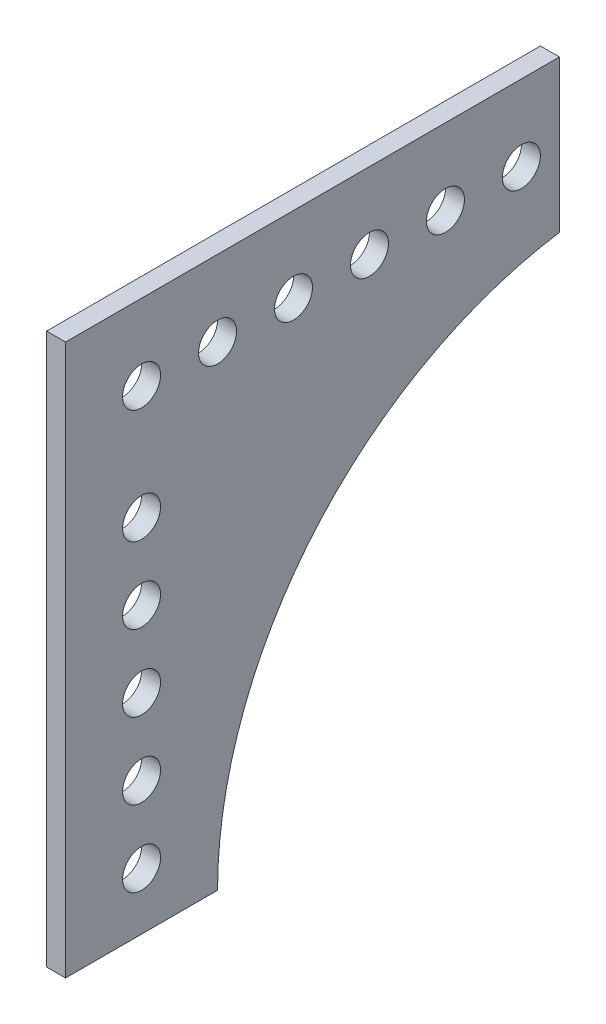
ISO-10303-21;
HEADER;
FILE_DESCRIPTION(('STEP AP214'),'2;1');
FILE_NAME('part.step','',(''),(''),'','','');
FILE_SCHEMA(('AUTOMOTIVE_DESIGN { 1 0 10303 214 1 1 1 1 }'));
ENDSEC;
DATA;
#1=APPLICATION_CONTEXT('core data for automotive mechanical design processes');
#2=APPLICATION_PROTOCOL_DEFINITION('international standard','automotive_design',2000,#1);
#3=PRODUCT_CONTEXT('',#1,'mechanical');
#4=PRODUCT('Part','Part','',(#3));
#5=PRODUCT_RELATED_PRODUCT_CATEGORY('part','',(#4));
#6=PRODUCT_DEFINITION_FORMATION('','',#4);
#7=PRODUCT_DEFINITION_CONTEXT('part definition',#1,'design');
#8=PRODUCT_DEFINITION('design','',#6,#7);
#9=PRODUCT_DEFINITION_SHAPE('','',#8);
#10=(LENGTH_UNIT() NAMED_UNIT(*) SI_UNIT(.MILLI.,.METRE.));
#11=(NAMED_UNIT(*) PLANE_ANGLE_UNIT() SI_UNIT($,.RADIAN.));
#12=(NAMED_UNIT(*) SI_UNIT($,.STERADIAN.) SOLID_ANGLE_UNIT());
#13=UNCERTAINTY_MEASURE_WITH_UNIT(LENGTH_MEASURE(1.E-05),#10,'distance_accuracy_value','');
#14=(GEOMETRIC_REPRESENTATION_CONTEXT(3) GLOBAL_UNCERTAINTY_ASSIGNED_CONTEXT((#13)) GLOBAL_UNIT_ASSIGNED_CONTEXT((#10,
#11,#12)) REPRESENTATION_CONTEXT('',''));
#15=CARTESIAN_POINT('',(0.,0.,0.));
#16=DIRECTION('',(0.,0.,1.));
#17=DIRECTION('',(1.,0.,0.));
#18=AXIS2_PLACEMENT_3D('',#15,#16,#17);
#19=CARTESIAN_POINT('',(149.574300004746,240.335090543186,0.));
#20=DIRECTION('',(0.,1.,0.));
#21=DIRECTION('',(0.,0.,1.));
#22=AXIS2_PLACEMENT_3D('',#19,#20,#21);
#23=PLANE('',#22);
#24=DIRECTION('',(0.,0.,-1.));
#25=VECTOR('',#24,1.);
#26=CARTESIAN_POINT('',(146.399300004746,240.335090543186,0.));
#27=LINE('',#26,#25);
#28=CARTESIAN_POINT('',(146.399300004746,240.335090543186,622.24027161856));
#29=VERTEX_POINT('',#28);
#30=CARTESIAN_POINT('',(146.399300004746,240.335090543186,596.84027161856));
#31=VERTEX_POINT('',#30);
#32=EDGE_CURVE('E157',#29,#31,#27,.T.);
#33=ORIENTED_EDGE('',*,*,#32,.T.);
#34=DIRECTION('',(-1.,0.,0.));
#35=VECTOR('',#34,1.);
#36=CARTESIAN_POINT('',(149.574300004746,240.335090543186,596.84027161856));
#37=LINE('',#36,#35);
#38=CARTESIAN_POINT('',(149.574300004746,240.335090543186,596.84027161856));
#39=VERTEX_POINT('',#38);
#40=EDGE_CURVE('E11',#39,#31,#37,.T.);
#41=ORIENTED_EDGE('',*,*,#40,.F.);
#42=DIRECTION('',(0.,0.,-1.));
#43=VECTOR('',#42,1.);
#44=CARTESIAN_POINT('',(149.574300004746,240.335090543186,0.));
#45=LINE('',#44,#43);
#46=CARTESIAN_POINT('',(149.574300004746,240.335090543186,622.24027161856));
#47=VERTEX_POINT('',#46);
#48=EDGE_CURVE('E116',#47,#39,#45,.T.);
#49=ORIENTED_EDGE('',*,*,#48,.F.);
#50=DIRECTION('',(-1.,0.,0.));
#51=VECTOR('',#50,1.);
#52=CARTESIAN_POINT('',(149.574300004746,240.335090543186,622.24027161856));
#53=LINE('',#52,#51);
#54=EDGE_CURVE('E57',#47,#29,#53,.T.);
#55=ORIENTED_EDGE('',*,*,#54,.T.);
#56=EDGE_LOOP('',(#33,#41,#49,#55));
#57=FACE_BOUND('',#56,.T.);
#58=ADVANCED_FACE('F39',(#57),#23,.F.);
#59=CARTESIAN_POINT('',(149.574300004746,240.335090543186,529.37152161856));
#60=DIRECTION('',(-1.,0.,0.));
#61=DIRECTION('',(0.,0.,1.));
#62=AXIS2_PLACEMENT_3D('',#59,#60,#61);
#63=CYLINDRICAL_SURFACE('',#62,67.46875);
#64=CARTESIAN_POINT('',(146.399300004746,240.335090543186,529.37152161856));
#65=DIRECTION('',(1.,0.,0.));
#66=DIRECTION('',(0.,0.,-1.));
#67=AXIS2_PLACEMENT_3D('',#64,#65,#66);
#68=CIRCLE('',#67,67.46875);
#69=CARTESIAN_POINT('',(146.399300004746,307.010090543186,539.69027161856));
#70=VERTEX_POINT('',#69);
#71=EDGE_CURVE('E160',#31,#70,#68,.F.);
#72=ORIENTED_EDGE('',*,*,#71,.T.);
#73=DIRECTION('',(-1.,0.,0.));
#74=VECTOR('',#73,1.);
#75=CARTESIAN_POINT('',(149.574300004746,307.010090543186,539.69027161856));
#76=LINE('',#75,#74);
#77=CARTESIAN_POINT('',(149.574300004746,307.010090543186,539.69027161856));
#78=VERTEX_POINT('',#77);
#79=EDGE_CURVE('E49',#78,#70,#76,.T.);
#80=ORIENTED_EDGE('',*,*,#79,.F.);
#81=CARTESIAN_POINT('',(149.574300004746,240.335090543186,529.37152161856));
#82=DIRECTION('',(1.,0.,0.));
#83=DIRECTION('',(0.,0.,-1.));
#84=AXIS2_PLACEMENT_3D('',#81,#82,#83);
#85=CIRCLE('',#84,67.46875);
#86=EDGE_CURVE('E89',#39,#78,#85,.F.);
#87=ORIENTED_EDGE('',*,*,#86,.F.);
#88=ORIENTED_EDGE('',*,*,#40,.T.);
#89=EDGE_LOOP('',(#72,#80,#87,#88));
#90=FACE_BOUND('',#89,.T.);
#91=ADVANCED_FACE('F190',(#90),#63,.F.);
#92=CARTESIAN_POINT('',(149.574300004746,0.,539.69027161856));
#93=DIRECTION('',(0.,0.,-1.));
#94=DIRECTION('',(-1.,0.,0.));
#95=AXIS2_PLACEMENT_3D('',#92,#93,#94);
#96=PLANE('',#95);
#97=DIRECTION('',(0.,-1.,0.));
#98=VECTOR('',#97,1.);
#99=CARTESIAN_POINT('',(146.399300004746,0.,539.69027161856));
#100=LINE('',#99,#98);
#101=CARTESIAN_POINT('',(146.399300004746,332.410090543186,539.69027161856));
#102=VERTEX_POINT('',#101);
#103=EDGE_CURVE('E102',#102,#70,#100,.T.);
#104=ORIENTED_EDGE('',*,*,#103,.F.);
#105=DIRECTION('',(-1.,0.,0.));
#106=VECTOR('',#105,1.);
#107=CARTESIAN_POINT('',(149.574300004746,332.410090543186,539.69027161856));
#108=LINE('',#107,#106);
#109=CARTESIAN_POINT('',(149.574300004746,332.410090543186,539.69027161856));
#110=VERTEX_POINT('',#109);
#111=EDGE_CURVE('E96',#110,#102,#108,.T.);
#112=ORIENTED_EDGE('',*,*,#111,.F.);
#113=DIRECTION('',(0.,-1.,0.));
#114=VECTOR('',#113,1.);
#115=CARTESIAN_POINT('',(149.574300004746,0.,539.69027161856));
#116=LINE('',#115,#114);
#117=EDGE_CURVE('E100',#110,#78,#116,.T.);
#118=ORIENTED_EDGE('',*,*,#117,.T.);
#119=ORIENTED_EDGE('',*,*,#79,.T.);
#120=EDGE_LOOP('',(#104,#112,#118,#119));
#121=FACE_BOUND('',#120,.T.);
#122=ADVANCED_FACE('F98',(#121),#96,.T.);
#123=CARTESIAN_POINT('',(149.574300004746,332.410090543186,0.));
#124=DIRECTION('',(0.,-1.,0.));
#125=DIRECTION('',(0.,0.,-1.));
#126=AXIS2_PLACEMENT_3D('',#123,#124,#125);
#127=PLANE('',#126);
#128=DIRECTION('',(0.,0.,1.));
#129=VECTOR('',#128,1.);
#130=CARTESIAN_POINT('',(146.399300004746,332.410090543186,0.));
#131=LINE('',#130,#129);
#132=CARTESIAN_POINT('',(146.399300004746,332.410090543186,622.24027161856));
#133=VERTEX_POINT('',#132);
#134=EDGE_CURVE('E165',#102,#133,#131,.T.);
#135=ORIENTED_EDGE('',*,*,#134,.T.);
#136=DIRECTION('',(-1.,0.,0.));
#137=VECTOR('',#136,1.);
#138=CARTESIAN_POINT('',(149.574300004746,332.410090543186,622.24027161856));
#139=LINE('',#138,#137);
#140=CARTESIAN_POINT('',(149.574300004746,332.410090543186,622.24027161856));
#141=VERTEX_POINT('',#140);
#142=EDGE_CURVE('E76',#141,#133,#139,.T.);
#143=ORIENTED_EDGE('',*,*,#142,.F.);
#144=DIRECTION('',(0.,0.,1.));
#145=VECTOR('',#144,1.);
#146=CARTESIAN_POINT('',(149.574300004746,332.410090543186,0.));
#147=LINE('',#146,#145);
#148=EDGE_CURVE('E106',#110,#141,#147,.T.);
#149=ORIENTED_EDGE('',*,*,#148,.F.);
#150=ORIENTED_EDGE('',*,*,#111,.T.);
#151=EDGE_LOOP('',(#135,#143,#149,#150));
#152=FACE_BOUND('',#151,.T.);
#153=ADVANCED_FACE('F107',(#152),#127,.F.);
#154=CARTESIAN_POINT('',(149.574300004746,319.710090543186,571.44027161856));
#155=DIRECTION('',(-1.,0.,0.));
#156=DIRECTION('',(0.,0.,1.));
#157=AXIS2_PLACEMENT_3D('',#154,#155,#156);
#158=CYLINDRICAL_SURFACE('',#157,3.17499999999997);
#159=CARTESIAN_POINT('',(149.574300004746,319.710090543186,571.44027161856));
#160=DIRECTION('',(1.,0.,0.));
#161=DIRECTION('',(0.,0.,-1.));
#162=AXIS2_PLACEMENT_3D('',#159,#160,#161);
#163=CIRCLE('',#162,3.17499999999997);
#164=CARTESIAN_POINT('',(149.574300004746,319.710090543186,568.265271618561));
#165=VERTEX_POINT('',#164);
#166=EDGE_CURVE('E133',#165,#165,#163,.F.);
#167=ORIENTED_EDGE('',*,*,#166,.F.);
#168=EDGE_LOOP('',(#167));
#169=FACE_BOUND('',#168,.T.);
#170=CARTESIAN_POINT('',(146.399300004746,319.710090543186,571.44027161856));
#171=DIRECTION('',(1.,0.,0.));
#172=DIRECTION('',(0.,0.,-1.));
#173=AXIS2_PLACEMENT_3D('',#170,#171,#172);
#174=CIRCLE('',#173,3.17499999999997);
#175=CARTESIAN_POINT('',(146.399300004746,319.710090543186,568.265271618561));
#176=VERTEX_POINT('',#175);
#177=EDGE_CURVE('E182',#176,#176,#174,.F.);
#178=ORIENTED_EDGE('',*,*,#177,.T.);
#179=EDGE_LOOP('',(#178));
#180=FACE_BOUND('',#179,.T.);
#181=ADVANCED_FACE('F260',(#169,#180),#158,.F.);
#182=CARTESIAN_POINT('',(149.574300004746,319.710090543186,546.04027161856));
#183=DIRECTION('',(-1.,0.,0.));
#184=DIRECTION('',(0.,0.,1.));
#185=AXIS2_PLACEMENT_3D('',#182,#183,#184);
#186=CYLINDRICAL_SURFACE('',#185,3.17499999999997);
#187=CARTESIAN_POINT('',(149.574300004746,319.710090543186,546.04027161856));
#188=DIRECTION('',(1.,0.,0.));
#189=DIRECTION('',(0.,0.,-1.));
#190=AXIS2_PLACEMENT_3D('',#187,#188,#189);
#191=CIRCLE('',#190,3.17499999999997);
#192=CARTESIAN_POINT('',(149.574300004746,319.710090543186,542.865271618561));
#193=VERTEX_POINT('',#192);
#194=EDGE_CURVE('E130',#193,#193,#191,.F.);
#195=ORIENTED_EDGE('',*,*,#194,.F.);
#196=EDGE_LOOP('',(#195));
#197=FACE_BOUND('',#196,.T.);
#198=CARTESIAN_POINT('',(146.399300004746,319.710090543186,546.04027161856));
#199=DIRECTION('',(1.,0.,0.));
#200=DIRECTION('',(0.,0.,-1.));
#201=AXIS2_PLACEMENT_3D('',#198,#199,#200);
#202=CIRCLE('',#201,3.17499999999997);
#203=CARTESIAN_POINT('',(146.399300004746,319.710090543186,542.865271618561));
#204=VERTEX_POINT('',#203);
#205=EDGE_CURVE('E179',#204,#204,#202,.F.);
#206=ORIENTED_EDGE('',*,*,#205,.T.);
#207=EDGE_LOOP('',(#206));
#208=FACE_BOUND('',#207,.T.);
#209=ADVANCED_FACE('F263',(#197,#208),#186,.F.);
#210=CARTESIAN_POINT('',(149.574300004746,319.710090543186,558.740271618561));
#211=DIRECTION('',(-1.,0.,0.));
#212=DIRECTION('',(0.,0.,1.));
#213=AXIS2_PLACEMENT_3D('',#210,#211,#212);
#214=CYLINDRICAL_SURFACE('',#213,3.17499999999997);
#215=CARTESIAN_POINT('',(149.574300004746,319.710090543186,558.740271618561));
#216=DIRECTION('',(1.,0.,0.));
#217=DIRECTION('',(0.,0.,-1.));
#218=AXIS2_PLACEMENT_3D('',#215,#216,#217);
#219=CIRCLE('',#218,3.17499999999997);
#220=CARTESIAN_POINT('',(149.574300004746,319.710090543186,555.565271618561));
#221=VERTEX_POINT('',#220);
#222=EDGE_CURVE('E127',#221,#221,#219,.F.);
#223=ORIENTED_EDGE('',*,*,#222,.F.);
#224=EDGE_LOOP('',(#223));
#225=FACE_BOUND('',#224,.T.);
#226=CARTESIAN_POINT('',(146.399300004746,319.710090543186,558.740271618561));
#227=DIRECTION('',(1.,0.,0.));
#228=DIRECTION('',(0.,0.,-1.));
#229=AXIS2_PLACEMENT_3D('',#226,#227,#228);
#230=CIRCLE('',#229,3.17499999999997);
#231=CARTESIAN_POINT('',(146.399300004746,319.710090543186,555.565271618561));
#232=VERTEX_POINT('',#231);
#233=EDGE_CURVE('E176',#232,#232,#230,.F.);
#234=ORIENTED_EDGE('',*,*,#233,.T.);
#235=EDGE_LOOP('',(#234));
#236=FACE_BOUND('',#235,.T.);
#237=ADVANCED_FACE('F267',(#225,#236),#214,.F.);
#238=CARTESIAN_POINT('',(149.574300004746,319.710090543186,584.140271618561));
#239=DIRECTION('',(-1.,0.,0.));
#240=DIRECTION('',(0.,0.,1.));
#241=AXIS2_PLACEMENT_3D('',#238,#239,#240);
#242=CYLINDRICAL_SURFACE('',#241,3.17499999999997);
#243=CARTESIAN_POINT('',(149.574300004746,319.710090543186,584.140271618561));
#244=DIRECTION('',(1.,0.,0.));
#245=DIRECTION('',(0.,0.,-1.));
#246=AXIS2_PLACEMENT_3D('',#243,#244,#245);
#247=CIRCLE('',#246,3.17499999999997);
#248=CARTESIAN_POINT('',(149.574300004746,319.710090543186,580.965271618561));
#249=VERTEX_POINT('',#248);
#250=EDGE_CURVE('E124',#249,#249,#247,.F.);
#251=ORIENTED_EDGE('',*,*,#250,.F.);
#252=EDGE_LOOP('',(#251));
#253=FACE_BOUND('',#252,.T.);
#254=CARTESIAN_POINT('',(146.399300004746,319.710090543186,584.140271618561));
#255=DIRECTION('',(1.,0.,0.));
#256=DIRECTION('',(0.,0.,-1.));
#257=AXIS2_PLACEMENT_3D('',#254,#255,#256);
#258=CIRCLE('',#257,3.17499999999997);
#259=CARTESIAN_POINT('',(146.399300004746,319.710090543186,580.965271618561));
#260=VERTEX_POINT('',#259);
#261=EDGE_CURVE('E173',#260,#260,#258,.F.);
#262=ORIENTED_EDGE('',*,*,#261,.T.);
#263=EDGE_LOOP('',(#262));
#264=FACE_BOUND('',#263,.T.);
#265=ADVANCED_FACE('F207',(#253,#264),#242,.F.);
#266=CARTESIAN_POINT('',(149.574300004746,319.710090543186,609.54027161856));
#267=DIRECTION('',(-1.,0.,0.));
#268=DIRECTION('',(0.,0.,1.));
#269=AXIS2_PLACEMENT_3D('',#266,#267,#268);
#270=CYLINDRICAL_SURFACE('',#269,3.17499999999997);
#271=CARTESIAN_POINT('',(149.574300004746,319.710090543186,609.54027161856));
#272=DIRECTION('',(1.,0.,0.));
#273=DIRECTION('',(0.,0.,-1.));
#274=AXIS2_PLACEMENT_3D('',#271,#272,#273);
#275=CIRCLE('',#274,3.17499999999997);
#276=CARTESIAN_POINT('',(149.574300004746,319.710090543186,606.365271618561));
#277=VERTEX_POINT('',#276);
#278=EDGE_CURVE('E121',#277,#277,#275,.F.);
#279=ORIENTED_EDGE('',*,*,#278,.F.);
#280=EDGE_LOOP('',(#279));
#281=FACE_BOUND('',#280,.T.);
#282=CARTESIAN_POINT('',(146.399300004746,319.710090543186,609.54027161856));
#283=DIRECTION('',(1.,0.,0.));
#284=DIRECTION('',(0.,0.,-1.));
#285=AXIS2_PLACEMENT_3D('',#282,#283,#284);
#286=CIRCLE('',#285,3.17499999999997);
#287=CARTESIAN_POINT('',(146.399300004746,319.710090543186,606.365271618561));
#288=VERTEX_POINT('',#287);
#289=EDGE_CURVE('E170',#288,#288,#286,.F.);
#290=ORIENTED_EDGE('',*,*,#289,.T.);
#291=EDGE_LOOP('',(#290));
#292=FACE_BOUND('',#291,.T.);
#293=ADVANCED_FACE('F198',(#281,#292),#270,.F.);
#294=CARTESIAN_POINT('',(149.574300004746,0.,622.24027161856));
#295=DIRECTION('',(0.,0.,1.));
#296=DIRECTION('',(1.,0.,0.));
#297=AXIS2_PLACEMENT_3D('',#294,#295,#296);
#298=PLANE('',#297);
#299=DIRECTION('',(0.,1.,0.));
#300=VECTOR('',#299,1.);
#301=CARTESIAN_POINT('',(146.399300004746,0.,622.24027161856));
#302=LINE('',#301,#300);
#303=EDGE_CURVE('E167',#29,#133,#302,.T.);
#304=ORIENTED_EDGE('',*,*,#303,.F.);
#305=ORIENTED_EDGE('',*,*,#54,.F.);
#306=DIRECTION('',(0.,1.,0.));
#307=VECTOR('',#306,1.);
#308=CARTESIAN_POINT('',(149.574300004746,0.,622.24027161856));
#309=LINE('',#308,#307);
#310=EDGE_CURVE('E110',#47,#141,#309,.T.);
#311=ORIENTED_EDGE('',*,*,#310,.T.);
#312=ORIENTED_EDGE('',*,*,#142,.T.);
#313=EDGE_LOOP('',(#304,#305,#311,#312));
#314=FACE_BOUND('',#313,.T.);
#315=ADVANCED_FACE('F195',(#314),#298,.T.);
#316=CARTESIAN_POINT('',(149.574300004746,300.660090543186,609.54027161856));
#317=DIRECTION('',(-1.,0.,0.));
#318=DIRECTION('',(0.,0.,1.));
#319=AXIS2_PLACEMENT_3D('',#316,#317,#318);
#320=CYLINDRICAL_SURFACE('',#319,3.17500000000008);
#321=CARTESIAN_POINT('',(149.574300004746,300.660090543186,609.54027161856));
#322=DIRECTION('',(1.,0.,0.));
#323=DIRECTION('',(0.,0.,-1.));
#324=AXIS2_PLACEMENT_3D('',#321,#322,#323);
#325=CIRCLE('',#324,3.17500000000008);
#326=CARTESIAN_POINT('',(149.574300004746,300.660090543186,606.36527161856));
#327=VERTEX_POINT('',#326);
#328=EDGE_CURVE('E456',#327,#327,#325,.T.);
#329=ORIENTED_EDGE('',*,*,#328,.T.);
#330=EDGE_LOOP('',(#329));
#331=FACE_BOUND('',#330,.T.);
#332=CARTESIAN_POINT('',(146.399300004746,300.660090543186,609.54027161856));
#333=DIRECTION('',(1.,0.,0.));
#334=DIRECTION('',(0.,0.,-1.));
#335=AXIS2_PLACEMENT_3D('',#332,#333,#334);
#336=CIRCLE('',#335,3.17500000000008);
#337=CARTESIAN_POINT('',(146.399300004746,300.660090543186,606.36527161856));
#338=VERTEX_POINT('',#337);
#339=EDGE_CURVE('E154',#338,#338,#336,.T.);
#340=ORIENTED_EDGE('',*,*,#339,.F.);
#341=EDGE_LOOP('',(#340));
#342=FACE_BOUND('',#341,.T.);
#343=ADVANCED_FACE('F197',(#331,#342),#320,.F.);
#344=CARTESIAN_POINT('',(149.574300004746,287.960090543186,609.54027161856));
#345=DIRECTION('',(-1.,0.,0.));
#346=DIRECTION('',(0.,0.,1.));
#347=AXIS2_PLACEMENT_3D('',#344,#345,#346);
#348=CYLINDRICAL_SURFACE('',#347,3.17500000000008);
#349=CARTESIAN_POINT('',(149.574300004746,287.960090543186,609.54027161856));
#350=DIRECTION('',(1.,0.,0.));
#351=DIRECTION('',(0.,0.,-1.));
#352=AXIS2_PLACEMENT_3D('',#349,#350,#351);
#353=CIRCLE('',#352,3.17500000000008);
#354=CARTESIAN_POINT('',(149.574300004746,287.960090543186,606.36527161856));
#355=VERTEX_POINT('',#354);
#356=EDGE_CURVE('E453',#355,#355,#353,.T.);
#357=ORIENTED_EDGE('',*,*,#356,.T.);
#358=EDGE_LOOP('',(#357));
#359=FACE_BOUND('',#358,.T.);
#360=CARTESIAN_POINT('',(146.399300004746,287.960090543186,609.54027161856));
#361=DIRECTION('',(1.,0.,0.));
#362=DIRECTION('',(0.,0.,-1.));
#363=AXIS2_PLACEMENT_3D('',#360,#361,#362);
#364=CIRCLE('',#363,3.17500000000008);
#365=CARTESIAN_POINT('',(146.399300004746,287.960090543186,606.36527161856));
#366=VERTEX_POINT('',#365);
#367=EDGE_CURVE('E151',#366,#366,#364,.T.);
#368=ORIENTED_EDGE('',*,*,#367,.F.);
#369=EDGE_LOOP('',(#368));
#370=FACE_BOUND('',#369,.T.);
#371=ADVANCED_FACE('F204',(#359,#370),#348,.F.);
#372=CARTESIAN_POINT('',(149.574300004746,275.260090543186,609.54027161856));
#373=DIRECTION('',(-1.,0.,0.));
#374=DIRECTION('',(0.,0.,1.));
#375=AXIS2_PLACEMENT_3D('',#372,#373,#374);
#376=CYLINDRICAL_SURFACE('',#375,3.17500000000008);
#377=CARTESIAN_POINT('',(149.574300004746,275.260090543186,609.54027161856));
#378=DIRECTION('',(1.,0.,0.));
#379=DIRECTION('',(0.,0.,-1.));
#380=AXIS2_PLACEMENT_3D('',#377,#378,#379);
#381=CIRCLE('',#380,3.17500000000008);
#382=CARTESIAN_POINT('',(149.574300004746,275.260090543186,606.36527161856));
#383=VERTEX_POINT('',#382);
#384=EDGE_CURVE('E449',#383,#383,#381,.T.);
#385=ORIENTED_EDGE('',*,*,#384,.T.);
#386=EDGE_LOOP('',(#385));
#387=FACE_BOUND('',#386,.T.);
#388=CARTESIAN_POINT('',(146.399300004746,275.260090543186,609.54027161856));
#389=DIRECTION('',(1.,0.,0.));
#390=DIRECTION('',(0.,0.,-1.));
#391=AXIS2_PLACEMENT_3D('',#388,#389,#390);
#392=CIRCLE('',#391,3.17500000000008);
#393=CARTESIAN_POINT('',(146.399300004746,275.260090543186,606.36527161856));
#394=VERTEX_POINT('',#393);
#395=EDGE_CURVE('E147',#394,#394,#392,.T.);
#396=ORIENTED_EDGE('',*,*,#395,.F.);
#397=EDGE_LOOP('',(#396));
#398=FACE_BOUND('',#397,.T.);
#399=ADVANCED_FACE('F221',(#387,#398),#376,.F.);
#400=CARTESIAN_POINT('',(149.574300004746,262.560090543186,609.54027161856));
#401=DIRECTION('',(-1.,0.,0.));
#402=DIRECTION('',(0.,0.,1.));
#403=AXIS2_PLACEMENT_3D('',#400,#401,#402);
#404=CYLINDRICAL_SURFACE('',#403,3.17500000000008);
#405=CARTESIAN_POINT('',(149.574300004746,262.560090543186,609.54027161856));
#406=DIRECTION('',(1.,0.,0.));
#407=DIRECTION('',(0.,0.,-1.));
#408=AXIS2_PLACEMENT_3D('',#405,#406,#407);
#409=CIRCLE('',#408,3.17500000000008);
#410=CARTESIAN_POINT('',(149.574300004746,262.560090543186,606.36527161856));
#411=VERTEX_POINT('',#410);
#412=EDGE_CURVE('E236',#411,#411,#409,.T.);
#413=ORIENTED_EDGE('',*,*,#412,.T.);
#414=EDGE_LOOP('',(#413));
#415=FACE_BOUND('',#414,.T.);
#416=CARTESIAN_POINT('',(146.399300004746,262.560090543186,609.54027161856));
#417=DIRECTION('',(1.,0.,0.));
#418=DIRECTION('',(0.,0.,-1.));
#419=AXIS2_PLACEMENT_3D('',#416,#417,#418);
#420=CIRCLE('',#419,3.17500000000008);
#421=CARTESIAN_POINT('',(146.399300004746,262.560090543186,606.36527161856));
#422=VERTEX_POINT('',#421);
#423=EDGE_CURVE('E143',#422,#422,#420,.T.);
#424=ORIENTED_EDGE('',*,*,#423,.F.);
#425=EDGE_LOOP('',(#424));
#426=FACE_BOUND('',#425,.T.);
#427=ADVANCED_FACE('F224',(#415,#426),#404,.F.);
#428=CARTESIAN_POINT('',(149.574300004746,249.860090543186,609.54027161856));
#429=DIRECTION('',(-1.,0.,0.));
#430=DIRECTION('',(0.,0.,1.));
#431=AXIS2_PLACEMENT_3D('',#428,#429,#430);
#432=CYLINDRICAL_SURFACE('',#431,3.17500000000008);
#433=CARTESIAN_POINT('',(149.574300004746,249.860090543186,609.54027161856));
#434=DIRECTION('',(1.,0.,0.));
#435=DIRECTION('',(0.,0.,-1.));
#436=AXIS2_PLACEMENT_3D('',#433,#434,#435);
#437=CIRCLE('',#436,3.17500000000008);
#438=CARTESIAN_POINT('',(149.574300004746,249.860090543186,606.36527161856));
#439=VERTEX_POINT('',#438);
#440=EDGE_CURVE('E188',#439,#439,#437,.T.);
#441=ORIENTED_EDGE('',*,*,#440,.T.);
#442=EDGE_LOOP('',(#441));
#443=FACE_BOUND('',#442,.T.);
#444=CARTESIAN_POINT('',(146.399300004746,249.860090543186,609.54027161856));
#445=DIRECTION('',(1.,0.,0.));
#446=DIRECTION('',(0.,0.,-1.));
#447=AXIS2_PLACEMENT_3D('',#444,#445,#446);
#448=CIRCLE('',#447,3.17500000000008);
#449=CARTESIAN_POINT('',(146.399300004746,249.860090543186,606.36527161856));
#450=VERTEX_POINT('',#449);
#451=EDGE_CURVE('E139',#450,#450,#448,.T.);
#452=ORIENTED_EDGE('',*,*,#451,.F.);
#453=EDGE_LOOP('',(#452));
#454=FACE_BOUND('',#453,.T.);
#455=ADVANCED_FACE('F41',(#443,#454),#432,.F.);
#456=CARTESIAN_POINT('',(149.574300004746,319.710090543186,596.840271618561));
#457=DIRECTION('',(-1.,0.,0.));
#458=DIRECTION('',(0.,0.,1.));
#459=AXIS2_PLACEMENT_3D('',#456,#457,#458);
#460=CYLINDRICAL_SURFACE('',#459,3.17499999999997);
#461=CARTESIAN_POINT('',(149.574300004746,319.710090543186,596.840271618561));
#462=DIRECTION('',(1.,0.,0.));
#463=DIRECTION('',(0.,0.,-1.));
#464=AXIS2_PLACEMENT_3D('',#461,#462,#463);
#465=CIRCLE('',#464,3.17499999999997);
#466=CARTESIAN_POINT('',(149.574300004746,319.710090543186,593.665271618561));
#467=VERTEX_POINT('',#466);
#468=EDGE_CURVE('E136',#467,#467,#465,.F.);
#469=ORIENTED_EDGE('',*,*,#468,.F.);
#470=EDGE_LOOP('',(#469));
#471=FACE_BOUND('',#470,.T.);
#472=CARTESIAN_POINT('',(146.399300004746,319.710090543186,596.840271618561));
#473=DIRECTION('',(1.,0.,0.));
#474=DIRECTION('',(0.,0.,-1.));
#475=AXIS2_PLACEMENT_3D('',#472,#473,#474);
#476=CIRCLE('',#475,3.17499999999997);
#477=CARTESIAN_POINT('',(146.399300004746,319.710090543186,593.665271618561));
#478=VERTEX_POINT('',#477);
#479=EDGE_CURVE('E185',#478,#478,#476,.F.);
#480=ORIENTED_EDGE('',*,*,#479,.T.);
#481=EDGE_LOOP('',(#480));
#482=FACE_BOUND('',#481,.T.);
#483=ADVANCED_FACE('F231',(#471,#482),#460,.F.);
#484=CARTESIAN_POINT('',(149.574300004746,0.,0.));
#485=DIRECTION('',(1.,0.,0.));
#486=DIRECTION('',(0.,0.,-1.));
#487=AXIS2_PLACEMENT_3D('',#484,#485,#486);
#488=PLANE('',#487);
#489=ORIENTED_EDGE('',*,*,#440,.F.);
#490=EDGE_LOOP('',(#489));
#491=FACE_BOUND('',#490,.T.);
#492=ORIENTED_EDGE('',*,*,#412,.F.);
#493=EDGE_LOOP('',(#492));
#494=FACE_BOUND('',#493,.T.);
#495=ORIENTED_EDGE('',*,*,#384,.F.);
#496=EDGE_LOOP('',(#495));
#497=FACE_BOUND('',#496,.T.);
#498=ORIENTED_EDGE('',*,*,#356,.F.);
#499=EDGE_LOOP('',(#498));
#500=FACE_BOUND('',#499,.T.);
#501=ORIENTED_EDGE('',*,*,#328,.F.);
#502=EDGE_LOOP('',(#501));
#503=FACE_BOUND('',#502,.T.);
#504=ORIENTED_EDGE('',*,*,#48,.T.);
#505=ORIENTED_EDGE('',*,*,#86,.T.);
#506=ORIENTED_EDGE('',*,*,#117,.F.);
#507=ORIENTED_EDGE('',*,*,#148,.T.);
#508=ORIENTED_EDGE('',*,*,#310,.F.);
#509=EDGE_LOOP('',(#504,#505,#506,#507,#508));
#510=FACE_BOUND('',#509,.T.);
#511=ORIENTED_EDGE('',*,*,#278,.T.);
#512=EDGE_LOOP('',(#511));
#513=FACE_BOUND('',#512,.T.);
#514=ORIENTED_EDGE('',*,*,#250,.T.);
#515=EDGE_LOOP('',(#514));
#516=FACE_BOUND('',#515,.T.);
#517=ORIENTED_EDGE('',*,*,#222,.T.);
#518=EDGE_LOOP('',(#517));
#519=FACE_BOUND('',#518,.T.);
#520=ORIENTED_EDGE('',*,*,#194,.T.);
#521=EDGE_LOOP('',(#520));
#522=FACE_BOUND('',#521,.T.);
#523=ORIENTED_EDGE('',*,*,#166,.T.);
#524=EDGE_LOOP('',(#523));
#525=FACE_BOUND('',#524,.T.);
#526=ORIENTED_EDGE('',*,*,#468,.T.);
#527=EDGE_LOOP('',(#526));
#528=FACE_BOUND('',#527,.T.);
#529=ADVANCED_FACE('F112',(#491,#494,#497,#500,#503,#510,#513,#516,#519,#522,#525,#528),#488,.T.);
#530=CARTESIAN_POINT('',(146.399300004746,0.,0.));
#531=DIRECTION('',(1.,0.,0.));
#532=DIRECTION('',(0.,0.,-1.));
#533=AXIS2_PLACEMENT_3D('',#530,#531,#532);
#534=PLANE('',#533);
#535=ORIENTED_EDGE('',*,*,#451,.T.);
#536=EDGE_LOOP('',(#535));
#537=FACE_BOUND('',#536,.T.);
#538=ORIENTED_EDGE('',*,*,#423,.T.);
#539=EDGE_LOOP('',(#538));
#540=FACE_BOUND('',#539,.T.);
#541=ORIENTED_EDGE('',*,*,#395,.T.);
#542=EDGE_LOOP('',(#541));
#543=FACE_BOUND('',#542,.T.);
#544=ORIENTED_EDGE('',*,*,#367,.T.);
#545=EDGE_LOOP('',(#544));
#546=FACE_BOUND('',#545,.T.);
#547=ORIENTED_EDGE('',*,*,#339,.T.);
#548=EDGE_LOOP('',(#547));
#549=FACE_BOUND('',#548,.T.);
#550=ORIENTED_EDGE('',*,*,#32,.F.);
#551=ORIENTED_EDGE('',*,*,#303,.T.);
#552=ORIENTED_EDGE('',*,*,#134,.F.);
#553=ORIENTED_EDGE('',*,*,#103,.T.);
#554=ORIENTED_EDGE('',*,*,#71,.F.);
#555=EDGE_LOOP('',(#550,#551,#552,#553,#554));
#556=FACE_BOUND('',#555,.T.);
#557=ORIENTED_EDGE('',*,*,#289,.F.);
#558=EDGE_LOOP('',(#557));
#559=FACE_BOUND('',#558,.T.);
#560=ORIENTED_EDGE('',*,*,#261,.F.);
#561=EDGE_LOOP('',(#560));
#562=FACE_BOUND('',#561,.T.);
#563=ORIENTED_EDGE('',*,*,#233,.F.);
#564=EDGE_LOOP('',(#563));
#565=FACE_BOUND('',#564,.T.);
#566=ORIENTED_EDGE('',*,*,#205,.F.);
#567=EDGE_LOOP('',(#566));
#568=FACE_BOUND('',#567,.T.);
#569=ORIENTED_EDGE('',*,*,#177,.F.);
#570=EDGE_LOOP('',(#569));
#571=FACE_BOUND('',#570,.T.);
#572=ORIENTED_EDGE('',*,*,#479,.F.);
#573=EDGE_LOOP('',(#572));
#574=FACE_BOUND('',#573,.T.);
#575=ADVANCED_FACE('F193',(#537,#540,#543,#546,#549,#556,#559,#562,#565,#568,#571,#574),#534,.F.);
#576=CLOSED_SHELL('',(#58,#91,#122,#153,#181,#209,#237,#265,#293,#315,#343,#371,#399,#427,#455,
#483,#529,#575));
#577=MANIFOLD_SOLID_BREP('B2',#576);
#578=ADVANCED_BREP_SHAPE_REPRESENTATION('',(#18,#577),#14);
#579=SHAPE_DEFINITION_REPRESENTATION(#9,#578);
ENDSEC;
END-ISO-10303-21;
